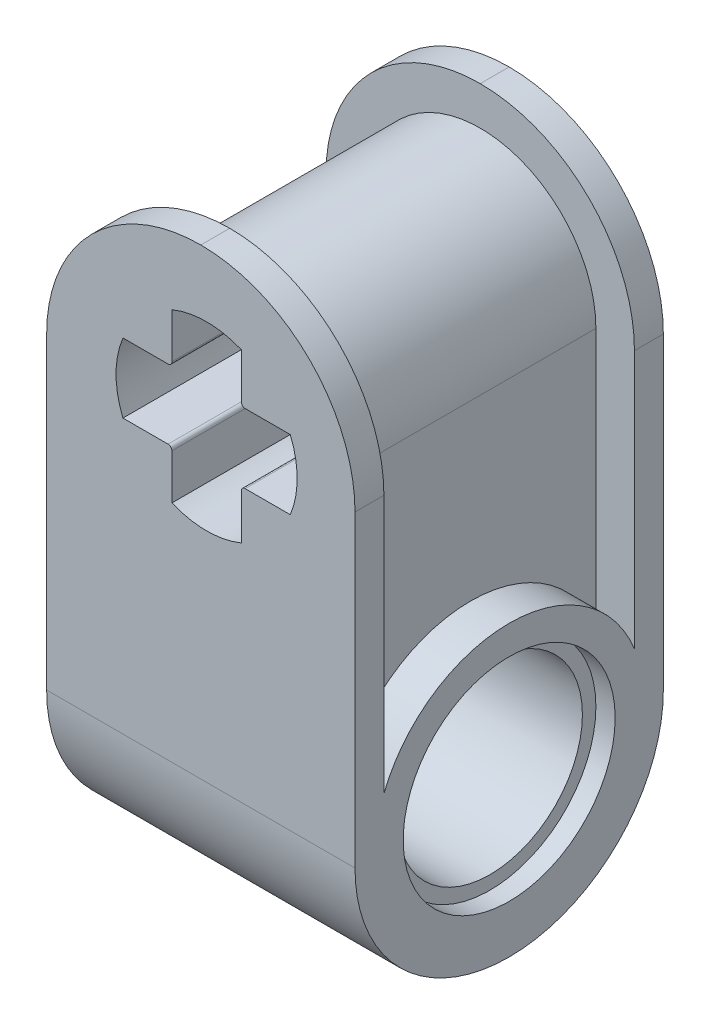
ISO-10303-21;
HEADER;
FILE_DESCRIPTION(('STEP AP214'),'2;1');
FILE_NAME('part.step','',(''),(''),'','','');
FILE_SCHEMA(('AUTOMOTIVE_DESIGN { 1 0 10303 214 1 1 1 1 }'));
ENDSEC;
DATA;
#1=APPLICATION_CONTEXT('core data for automotive mechanical design processes');
#2=APPLICATION_PROTOCOL_DEFINITION('international standard','automotive_design',2000,#1);
#3=PRODUCT_CONTEXT('',#1,'mechanical');
#4=PRODUCT('Part','Part','',(#3));
#5=PRODUCT_RELATED_PRODUCT_CATEGORY('part','',(#4));
#6=PRODUCT_DEFINITION_FORMATION('','',#4);
#7=PRODUCT_DEFINITION_CONTEXT('part definition',#1,'design');
#8=PRODUCT_DEFINITION('design','',#6,#7);
#9=PRODUCT_DEFINITION_SHAPE('','',#8);
#10=(LENGTH_UNIT() NAMED_UNIT(*) SI_UNIT(.MILLI.,.METRE.));
#11=(NAMED_UNIT(*) PLANE_ANGLE_UNIT() SI_UNIT($,.RADIAN.));
#12=(NAMED_UNIT(*) SI_UNIT($,.STERADIAN.) SOLID_ANGLE_UNIT());
#13=UNCERTAINTY_MEASURE_WITH_UNIT(LENGTH_MEASURE(1.E-05),#10,'distance_accuracy_value','');
#14=(GEOMETRIC_REPRESENTATION_CONTEXT(3) GLOBAL_UNCERTAINTY_ASSIGNED_CONTEXT((#13)) GLOBAL_UNIT_ASSIGNED_CONTEXT((#10,
#11,#12)) REPRESENTATION_CONTEXT('',''));
#15=CARTESIAN_POINT('',(0.,0.,0.));
#16=DIRECTION('',(0.,0.,1.));
#17=DIRECTION('',(1.,0.,0.));
#18=AXIS2_PLACEMENT_3D('',#15,#16,#17);
#19=CARTESIAN_POINT('',(-4.,0.,0.));
#20=DIRECTION('',(1.,0.,0.));
#21=DIRECTION('',(0.,0.,-1.));
#22=AXIS2_PLACEMENT_3D('',#19,#20,#21);
#23=PLANE('',#22);
#24=CARTESIAN_POINT('',(-4.,0.,0.));
#25=DIRECTION('',(1.,0.,0.));
#26=DIRECTION('',(0.,0.,-1.));
#27=AXIS2_PLACEMENT_3D('',#24,#25,#26);
#28=CIRCLE('',#27,2.75);
#29=CARTESIAN_POINT('',(-4.,0.,-2.75));
#30=VERTEX_POINT('',#29);
#31=EDGE_CURVE('E374',#30,#30,#28,.T.);
#32=ORIENTED_EDGE('',*,*,#31,.T.);
#33=EDGE_LOOP('',(#32));
#34=FACE_BOUND('',#33,.T.);
#35=DIRECTION('',(0.,-1.,0.));
#36=VECTOR('',#35,1.);
#37=CARTESIAN_POINT('',(-4.,0.,4.));
#38=LINE('',#37,#36);
#39=CARTESIAN_POINT('',(-4.,8.,4.));
#40=VERTEX_POINT('',#39);
#41=CARTESIAN_POINT('',(-4.,0.,4.));
#42=VERTEX_POINT('',#41);
#43=EDGE_CURVE('E422',#40,#42,#38,.T.);
#44=ORIENTED_EDGE('',*,*,#43,.F.);
#45=DIRECTION('',(0.,0.,1.));
#46=VECTOR('',#45,1.);
#47=CARTESIAN_POINT('',(-4.,8.,0.));
#48=LINE('',#47,#46);
#49=CARTESIAN_POINT('',(-4.,8.,3.25));
#50=VERTEX_POINT('',#49);
#51=EDGE_CURVE('E449',#40,#50,#48,.F.);
#52=ORIENTED_EDGE('',*,*,#51,.T.);
#53=DIRECTION('',(0.,-1.,0.));
#54=VECTOR('',#53,1.);
#55=CARTESIAN_POINT('',(-4.,8.,3.25));
#56=LINE('',#55,#54);
#57=CARTESIAN_POINT('',(-4.,1.29903810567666,3.25));
#58=VERTEX_POINT('',#57);
#59=EDGE_CURVE('E266',#50,#58,#56,.T.);
#60=ORIENTED_EDGE('',*,*,#59,.T.);
#61=CARTESIAN_POINT('',(-4.,0.,0.));
#62=DIRECTION('',(1.,0.,0.));
#63=DIRECTION('',(0.,0.,-1.));
#64=AXIS2_PLACEMENT_3D('',#61,#62,#63);
#65=CIRCLE('',#64,3.5);
#66=CARTESIAN_POINT('',(-4.,1.29903810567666,-3.25));
#67=VERTEX_POINT('',#66);
#68=EDGE_CURVE('E248',#67,#58,#65,.T.);
#69=ORIENTED_EDGE('',*,*,#68,.F.);
#70=DIRECTION('',(0.,-1.,0.));
#71=VECTOR('',#70,1.);
#72=CARTESIAN_POINT('',(-4.,8.,-3.25));
#73=LINE('',#72,#71);
#74=CARTESIAN_POINT('',(-4.,8.,-3.25));
#75=VERTEX_POINT('',#74);
#76=EDGE_CURVE('E269',#75,#67,#73,.T.);
#77=ORIENTED_EDGE('',*,*,#76,.F.);
#78=DIRECTION('',(0.,0.,1.));
#79=VECTOR('',#78,1.);
#80=CARTESIAN_POINT('',(-4.,8.,0.));
#81=LINE('',#80,#79);
#82=CARTESIAN_POINT('',(-4.,8.,-4.));
#83=VERTEX_POINT('',#82);
#84=EDGE_CURVE('E447',#75,#83,#81,.F.);
#85=ORIENTED_EDGE('',*,*,#84,.T.);
#86=DIRECTION('',(0.,1.,0.));
#87=VECTOR('',#86,1.);
#88=CARTESIAN_POINT('',(-4.,0.,-4.));
#89=LINE('',#88,#87);
#90=CARTESIAN_POINT('',(-4.,0.,-4.));
#91=VERTEX_POINT('',#90);
#92=EDGE_CURVE('E431',#91,#83,#89,.T.);
#93=ORIENTED_EDGE('',*,*,#92,.F.);
#94=CARTESIAN_POINT('',(-4.,0.,0.));
#95=DIRECTION('',(1.,0.,0.));
#96=DIRECTION('',(0.,0.,-1.));
#97=AXIS2_PLACEMENT_3D('',#94,#95,#96);
#98=CIRCLE('',#97,4.);
#99=EDGE_CURVE('E428',#42,#91,#98,.T.);
#100=ORIENTED_EDGE('',*,*,#99,.F.);
#101=EDGE_LOOP('',(#44,#52,#60,#69,#77,#85,#93,#100));
#102=FACE_BOUND('',#101,.T.);
#103=ADVANCED_FACE('F37',(#34,#102),#23,.F.);
#104=CARTESIAN_POINT('',(4.,0.,0.));
#105=DIRECTION('',(1.,0.,0.));
#106=DIRECTION('',(0.,0.,-1.));
#107=AXIS2_PLACEMENT_3D('',#104,#105,#106);
#108=PLANE('',#107);
#109=DIRECTION('',(0.,1.,0.));
#110=VECTOR('',#109,1.);
#111=CARTESIAN_POINT('',(4.,12.,3.25));
#112=LINE('',#111,#110);
#113=CARTESIAN_POINT('',(4.,1.29903810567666,3.25));
#114=VERTEX_POINT('',#113);
#115=CARTESIAN_POINT('',(4.,8.,3.25));
#116=VERTEX_POINT('',#115);
#117=EDGE_CURVE('E265',#114,#116,#112,.T.);
#118=ORIENTED_EDGE('',*,*,#117,.T.);
#119=DIRECTION('',(0.,0.,1.));
#120=VECTOR('',#119,1.);
#121=CARTESIAN_POINT('',(4.,8.,4.));
#122=LINE('',#121,#120);
#123=CARTESIAN_POINT('',(4.,8.,4.));
#124=VERTEX_POINT('',#123);
#125=EDGE_CURVE('E459',#116,#124,#122,.T.);
#126=ORIENTED_EDGE('',*,*,#125,.T.);
#127=DIRECTION('',(0.,-1.,0.));
#128=VECTOR('',#127,1.);
#129=CARTESIAN_POINT('',(4.,0.,4.));
#130=LINE('',#129,#128);
#131=CARTESIAN_POINT('',(4.,0.,4.));
#132=VERTEX_POINT('',#131);
#133=EDGE_CURVE('E425',#124,#132,#130,.T.);
#134=ORIENTED_EDGE('',*,*,#133,.T.);
#135=CARTESIAN_POINT('',(4.,0.,0.));
#136=DIRECTION('',(1.,0.,0.));
#137=DIRECTION('',(0.,0.,-1.));
#138=AXIS2_PLACEMENT_3D('',#135,#136,#137);
#139=CIRCLE('',#138,4.);
#140=CARTESIAN_POINT('',(4.,0.,-4.));
#141=VERTEX_POINT('',#140);
#142=EDGE_CURVE('E418',#132,#141,#139,.T.);
#143=ORIENTED_EDGE('',*,*,#142,.T.);
#144=DIRECTION('',(0.,1.,0.));
#145=VECTOR('',#144,1.);
#146=CARTESIAN_POINT('',(4.,0.,-4.));
#147=LINE('',#146,#145);
#148=CARTESIAN_POINT('',(4.,8.,-4.));
#149=VERTEX_POINT('',#148);
#150=EDGE_CURVE('E421',#141,#149,#147,.T.);
#151=ORIENTED_EDGE('',*,*,#150,.T.);
#152=DIRECTION('',(0.,0.,1.));
#153=VECTOR('',#152,1.);
#154=CARTESIAN_POINT('',(4.,8.,-3.25));
#155=LINE('',#154,#153);
#156=CARTESIAN_POINT('',(4.,8.,-3.25));
#157=VERTEX_POINT('',#156);
#158=EDGE_CURVE('E456',#149,#157,#155,.T.);
#159=ORIENTED_EDGE('',*,*,#158,.T.);
#160=DIRECTION('',(0.,1.,0.));
#161=VECTOR('',#160,1.);
#162=CARTESIAN_POINT('',(4.,12.,-3.25));
#163=LINE('',#162,#161);
#164=CARTESIAN_POINT('',(4.,1.29903810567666,-3.25));
#165=VERTEX_POINT('',#164);
#166=EDGE_CURVE('E258',#165,#157,#163,.T.);
#167=ORIENTED_EDGE('',*,*,#166,.F.);
#168=CARTESIAN_POINT('',(4.,0.,0.));
#169=DIRECTION('',(-1.,0.,0.));
#170=DIRECTION('',(0.,0.,-1.));
#171=AXIS2_PLACEMENT_3D('',#168,#169,#170);
#172=CIRCLE('',#171,3.5);
#173=EDGE_CURVE('E496',#114,#165,#172,.T.);
#174=ORIENTED_EDGE('',*,*,#173,.F.);
#175=EDGE_LOOP('',(#118,#126,#134,#143,#151,#159,#167,#174));
#176=FACE_BOUND('',#175,.T.);
#177=CARTESIAN_POINT('',(4.,0.,0.));
#178=DIRECTION('',(1.,0.,0.));
#179=DIRECTION('',(0.,0.,-1.));
#180=AXIS2_PLACEMENT_3D('',#177,#178,#179);
#181=CIRCLE('',#180,2.75);
#182=CARTESIAN_POINT('',(4.,0.,-2.75));
#183=VERTEX_POINT('',#182);
#184=EDGE_CURVE('E415',#183,#183,#181,.T.);
#185=ORIENTED_EDGE('',*,*,#184,.F.);
#186=EDGE_LOOP('',(#185));
#187=FACE_BOUND('',#186,.T.);
#188=ADVANCED_FACE('F494',(#176,#187),#108,.T.);
#189=CARTESIAN_POINT('',(4.,0.,0.));
#190=DIRECTION('',(-1.,0.,0.));
#191=DIRECTION('',(0.,0.,1.));
#192=AXIS2_PLACEMENT_3D('',#189,#190,#191);
#193=CYLINDRICAL_SURFACE('',#192,2.4);
#194=CARTESIAN_POINT('',(3.5,0.,0.));
#195=DIRECTION('',(1.,0.,0.));
#196=DIRECTION('',(0.,0.,-1.));
#197=AXIS2_PLACEMENT_3D('',#194,#195,#196);
#198=CIRCLE('',#197,2.4);
#199=CARTESIAN_POINT('',(3.5,0.,-2.4));
#200=VERTEX_POINT('',#199);
#201=EDGE_CURVE('E414',#200,#200,#198,.T.);
#202=ORIENTED_EDGE('',*,*,#201,.T.);
#203=EDGE_LOOP('',(#202));
#204=FACE_BOUND('',#203,.T.);
#205=CARTESIAN_POINT('',(-3.5,0.,0.));
#206=DIRECTION('',(-1.,0.,0.));
#207=DIRECTION('',(0.,0.,1.));
#208=AXIS2_PLACEMENT_3D('',#205,#206,#207);
#209=CIRCLE('',#208,2.4);
#210=CARTESIAN_POINT('',(-3.5,0.,2.4));
#211=VERTEX_POINT('',#210);
#212=EDGE_CURVE('E408',#211,#211,#209,.T.);
#213=ORIENTED_EDGE('',*,*,#212,.T.);
#214=EDGE_LOOP('',(#213));
#215=FACE_BOUND('',#214,.T.);
#216=ADVANCED_FACE('F534',(#204,#215),#193,.F.);
#217=CARTESIAN_POINT('',(4.,0.,0.));
#218=DIRECTION('',(-1.,0.,0.));
#219=DIRECTION('',(0.,0.,1.));
#220=AXIS2_PLACEMENT_3D('',#217,#218,#219);
#221=CYLINDRICAL_SURFACE('',#220,4.);
#222=ORIENTED_EDGE('',*,*,#99,.T.);
#223=DIRECTION('',(-1.,0.,0.));
#224=VECTOR('',#223,1.);
#225=CARTESIAN_POINT('',(4.,0.,-4.));
#226=LINE('',#225,#224);
#227=EDGE_CURVE('E436',#141,#91,#226,.T.);
#228=ORIENTED_EDGE('',*,*,#227,.F.);
#229=ORIENTED_EDGE('',*,*,#142,.F.);
#230=DIRECTION('',(-1.,0.,0.));
#231=VECTOR('',#230,1.);
#232=CARTESIAN_POINT('',(4.,0.,4.));
#233=LINE('',#232,#231);
#234=EDGE_CURVE('E427',#132,#42,#233,.T.);
#235=ORIENTED_EDGE('',*,*,#234,.T.);
#236=EDGE_LOOP('',(#222,#228,#229,#235));
#237=FACE_BOUND('',#236,.T.);
#238=ADVANCED_FACE('F502',(#237),#221,.T.);
#239=CARTESIAN_POINT('',(4.,0.,-4.));
#240=DIRECTION('',(0.,0.,1.));
#241=DIRECTION('',(1.,0.,0.));
#242=AXIS2_PLACEMENT_3D('',#239,#240,#241);
#243=PLANE('',#242);
#244=DIRECTION('',(-1.,0.,0.));
#245=VECTOR('',#244,1.);
#246=CARTESIAN_POINT('',(-2.02082933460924,8.9,-4.));
#247=LINE('',#246,#245);
#248=CARTESIAN_POINT('',(-0.85,8.9,-4.));
#249=VERTEX_POINT('',#248);
#250=CARTESIAN_POINT('',(-2.02082933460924,8.9,-4.));
#251=VERTEX_POINT('',#250);
#252=EDGE_CURVE('E323',#249,#251,#247,.T.);
#253=ORIENTED_EDGE('',*,*,#252,.T.);
#254=CARTESIAN_POINT('',(0.15,8.,-4.));
#255=DIRECTION('',(0.,0.,1.));
#256=DIRECTION('',(1.,0.,0.));
#257=AXIS2_PLACEMENT_3D('',#254,#255,#256);
#258=CIRCLE('',#257,2.35);
#259=CARTESIAN_POINT('',(-2.02082933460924,7.1,-4.));
#260=VERTEX_POINT('',#259);
#261=EDGE_CURVE('E277',#251,#260,#258,.T.);
#262=ORIENTED_EDGE('',*,*,#261,.T.);
#263=DIRECTION('',(1.,0.,0.));
#264=VECTOR('',#263,1.);
#265=CARTESIAN_POINT('',(-2.02082933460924,7.1,-4.));
#266=LINE('',#265,#264);
#267=CARTESIAN_POINT('',(-0.85,7.1,-4.));
#268=VERTEX_POINT('',#267);
#269=EDGE_CURVE('E280',#260,#268,#266,.T.);
#270=ORIENTED_EDGE('',*,*,#269,.T.);
#271=CARTESIAN_POINT('',(-0.85,7.,-4.));
#272=DIRECTION('',(0.,0.,-1.));
#273=DIRECTION('',(-1.,0.,0.));
#274=AXIS2_PLACEMENT_3D('',#271,#272,#273);
#275=CIRCLE('',#274,0.0999999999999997);
#276=CARTESIAN_POINT('',(-0.75,7.,-4.));
#277=VERTEX_POINT('',#276);
#278=EDGE_CURVE('E284',#268,#277,#275,.T.);
#279=ORIENTED_EDGE('',*,*,#278,.T.);
#280=DIRECTION('',(0.,-1.,0.));
#281=VECTOR('',#280,1.);
#282=CARTESIAN_POINT('',(-0.75,7.,-4.));
#283=LINE('',#282,#281);
#284=CARTESIAN_POINT('',(-0.75,5.82917066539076,-4.));
#285=VERTEX_POINT('',#284);
#286=EDGE_CURVE('E287',#277,#285,#283,.T.);
#287=ORIENTED_EDGE('',*,*,#286,.T.);
#288=CARTESIAN_POINT('',(0.15,8.,-4.));
#289=DIRECTION('',(0.,0.,1.));
#290=DIRECTION('',(-1.,0.,0.));
#291=AXIS2_PLACEMENT_3D('',#288,#289,#290);
#292=CIRCLE('',#291,2.35);
#293=CARTESIAN_POINT('',(1.05,5.82917066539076,-4.));
#294=VERTEX_POINT('',#293);
#295=EDGE_CURVE('E290',#285,#294,#292,.T.);
#296=ORIENTED_EDGE('',*,*,#295,.T.);
#297=DIRECTION('',(0.,1.,0.));
#298=VECTOR('',#297,1.);
#299=CARTESIAN_POINT('',(1.05,7.,-4.));
#300=LINE('',#299,#298);
#301=CARTESIAN_POINT('',(1.05,7.,-4.));
#302=VERTEX_POINT('',#301);
#303=EDGE_CURVE('E293',#294,#302,#300,.T.);
#304=ORIENTED_EDGE('',*,*,#303,.T.);
#305=CARTESIAN_POINT('',(1.15,7.,-4.));
#306=DIRECTION('',(0.,0.,-1.));
#307=DIRECTION('',(1.,0.,0.));
#308=AXIS2_PLACEMENT_3D('',#305,#306,#307);
#309=CIRCLE('',#308,0.0999999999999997);
#310=CARTESIAN_POINT('',(1.15,7.1,-4.));
#311=VERTEX_POINT('',#310);
#312=EDGE_CURVE('E296',#302,#311,#309,.T.);
#313=ORIENTED_EDGE('',*,*,#312,.T.);
#314=DIRECTION('',(1.,0.,0.));
#315=VECTOR('',#314,1.);
#316=CARTESIAN_POINT('',(2.32082933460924,7.1,-4.));
#317=LINE('',#316,#315);
#318=CARTESIAN_POINT('',(2.32082933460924,7.1,-4.));
#319=VERTEX_POINT('',#318);
#320=EDGE_CURVE('E299',#311,#319,#317,.T.);
#321=ORIENTED_EDGE('',*,*,#320,.T.);
#322=CARTESIAN_POINT('',(0.15,8.,-4.));
#323=DIRECTION('',(0.,0.,1.));
#324=DIRECTION('',(-1.,0.,0.));
#325=AXIS2_PLACEMENT_3D('',#322,#323,#324);
#326=CIRCLE('',#325,2.35);
#327=CARTESIAN_POINT('',(2.32082933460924,8.9,-4.));
#328=VERTEX_POINT('',#327);
#329=EDGE_CURVE('E302',#319,#328,#326,.T.);
#330=ORIENTED_EDGE('',*,*,#329,.T.);
#331=DIRECTION('',(-1.,0.,0.));
#332=VECTOR('',#331,1.);
#333=CARTESIAN_POINT('',(2.32082933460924,8.9,-4.));
#334=LINE('',#333,#332);
#335=CARTESIAN_POINT('',(1.15,8.9,-4.));
#336=VERTEX_POINT('',#335);
#337=EDGE_CURVE('E305',#328,#336,#334,.T.);
#338=ORIENTED_EDGE('',*,*,#337,.T.);
#339=CARTESIAN_POINT('',(1.15,9.,-4.));
#340=DIRECTION('',(0.,0.,-1.));
#341=DIRECTION('',(-1.,0.,0.));
#342=AXIS2_PLACEMENT_3D('',#339,#340,#341);
#343=CIRCLE('',#342,0.0999999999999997);
#344=CARTESIAN_POINT('',(1.05,9.,-4.));
#345=VERTEX_POINT('',#344);
#346=EDGE_CURVE('E308',#336,#345,#343,.T.);
#347=ORIENTED_EDGE('',*,*,#346,.T.);
#348=DIRECTION('',(0.,1.,0.));
#349=VECTOR('',#348,1.);
#350=CARTESIAN_POINT('',(1.05,9.,-4.));
#351=LINE('',#350,#349);
#352=CARTESIAN_POINT('',(1.05,10.1708293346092,-4.));
#353=VERTEX_POINT('',#352);
#354=EDGE_CURVE('E311',#345,#353,#351,.T.);
#355=ORIENTED_EDGE('',*,*,#354,.T.);
#356=CARTESIAN_POINT('',(0.15,8.,-4.));
#357=DIRECTION('',(0.,0.,1.));
#358=DIRECTION('',(1.,0.,0.));
#359=AXIS2_PLACEMENT_3D('',#356,#357,#358);
#360=CIRCLE('',#359,2.35);
#361=CARTESIAN_POINT('',(-0.75,10.1708293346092,-4.));
#362=VERTEX_POINT('',#361);
#363=EDGE_CURVE('E314',#353,#362,#360,.T.);
#364=ORIENTED_EDGE('',*,*,#363,.T.);
#365=DIRECTION('',(0.,-1.,0.));
#366=VECTOR('',#365,1.);
#367=CARTESIAN_POINT('',(-0.75,9.,-4.));
#368=LINE('',#367,#366);
#369=CARTESIAN_POINT('',(-0.750000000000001,9.,-4.));
#370=VERTEX_POINT('',#369);
#371=EDGE_CURVE('E317',#362,#370,#368,.T.);
#372=ORIENTED_EDGE('',*,*,#371,.T.);
#373=CARTESIAN_POINT('',(-0.85,9.,-4.));
#374=DIRECTION('',(0.,0.,-1.));
#375=DIRECTION('',(1.,0.,0.));
#376=AXIS2_PLACEMENT_3D('',#373,#374,#375);
#377=CIRCLE('',#376,0.0999999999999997);
#378=EDGE_CURVE('E320',#370,#249,#377,.T.);
#379=ORIENTED_EDGE('',*,*,#378,.T.);
#380=EDGE_LOOP('',(#253,#262,#270,#279,#287,#296,#304,#313,#321,#330,#338,#347,#355,#364,#372,#379));
#381=FACE_BOUND('',#380,.T.);
#382=CARTESIAN_POINT('',(0.,8.,-4.));
#383=DIRECTION('',(0.,0.,1.));
#384=DIRECTION('',(1.,0.,0.));
#385=AXIS2_PLACEMENT_3D('',#382,#383,#384);
#386=CIRCLE('',#385,4.);
#387=CARTESIAN_POINT('',(0.,12.,-4.));
#388=VERTEX_POINT('',#387);
#389=EDGE_CURVE('E46',#83,#388,#386,.F.);
#390=ORIENTED_EDGE('',*,*,#389,.T.);
#391=CARTESIAN_POINT('',(0.,8.,-4.));
#392=DIRECTION('',(0.,0.,1.));
#393=DIRECTION('',(1.,0.,0.));
#394=AXIS2_PLACEMENT_3D('',#391,#392,#393);
#395=CIRCLE('',#394,4.);
#396=EDGE_CURVE('E11',#388,#149,#395,.F.);
#397=ORIENTED_EDGE('',*,*,#396,.T.);
#398=ORIENTED_EDGE('',*,*,#150,.F.);
#399=ORIENTED_EDGE('',*,*,#227,.T.);
#400=ORIENTED_EDGE('',*,*,#92,.T.);
#401=EDGE_LOOP('',(#390,#397,#398,#399,#400));
#402=FACE_BOUND('',#401,.T.);
#403=ADVANCED_FACE('F499',(#381,#402),#243,.F.);
#404=CARTESIAN_POINT('',(4.,0.,4.));
#405=DIRECTION('',(0.,0.,-1.));
#406=DIRECTION('',(-1.,0.,0.));
#407=AXIS2_PLACEMENT_3D('',#404,#405,#406);
#408=PLANE('',#407);
#409=DIRECTION('',(1.,0.,0.));
#410=VECTOR('',#409,1.);
#411=CARTESIAN_POINT('',(-2.02082933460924,7.1,4.));
#412=LINE('',#411,#410);
#413=CARTESIAN_POINT('',(-2.02082933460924,7.1,4.));
#414=VERTEX_POINT('',#413);
#415=CARTESIAN_POINT('',(-0.85,7.1,4.));
#416=VERTEX_POINT('',#415);
#417=EDGE_CURVE('E328',#414,#416,#412,.T.);
#418=ORIENTED_EDGE('',*,*,#417,.F.);
#419=CARTESIAN_POINT('',(0.15,8.,4.));
#420=DIRECTION('',(0.,0.,1.));
#421=DIRECTION('',(1.,0.,0.));
#422=AXIS2_PLACEMENT_3D('',#419,#420,#421);
#423=CIRCLE('',#422,2.35);
#424=CARTESIAN_POINT('',(-2.02082933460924,8.9,4.));
#425=VERTEX_POINT('',#424);
#426=EDGE_CURVE('E275',#425,#414,#423,.T.);
#427=ORIENTED_EDGE('',*,*,#426,.F.);
#428=DIRECTION('',(-1.,0.,0.));
#429=VECTOR('',#428,1.);
#430=CARTESIAN_POINT('',(-2.02082933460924,8.9,4.));
#431=LINE('',#430,#429);
#432=CARTESIAN_POINT('',(-0.85,8.9,4.));
#433=VERTEX_POINT('',#432);
#434=EDGE_CURVE('E281',#433,#425,#431,.T.);
#435=ORIENTED_EDGE('',*,*,#434,.F.);
#436=CARTESIAN_POINT('',(-0.85,9.,4.));
#437=DIRECTION('',(0.,0.,-1.));
#438=DIRECTION('',(1.,0.,0.));
#439=AXIS2_PLACEMENT_3D('',#436,#437,#438);
#440=CIRCLE('',#439,0.0999999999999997);
#441=CARTESIAN_POINT('',(-0.750000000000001,9.,4.));
#442=VERTEX_POINT('',#441);
#443=EDGE_CURVE('E367',#442,#433,#440,.T.);
#444=ORIENTED_EDGE('',*,*,#443,.F.);
#445=DIRECTION('',(0.,-1.,0.));
#446=VECTOR('',#445,1.);
#447=CARTESIAN_POINT('',(-0.75,9.,4.));
#448=LINE('',#447,#446);
#449=CARTESIAN_POINT('',(-0.75,10.1708293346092,4.));
#450=VERTEX_POINT('',#449);
#451=EDGE_CURVE('E364',#450,#442,#448,.T.);
#452=ORIENTED_EDGE('',*,*,#451,.F.);
#453=CARTESIAN_POINT('',(0.15,8.,4.));
#454=DIRECTION('',(0.,0.,1.));
#455=DIRECTION('',(1.,0.,0.));
#456=AXIS2_PLACEMENT_3D('',#453,#454,#455);
#457=CIRCLE('',#456,2.35);
#458=CARTESIAN_POINT('',(1.05,10.1708293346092,4.));
#459=VERTEX_POINT('',#458);
#460=EDGE_CURVE('E361',#459,#450,#457,.T.);
#461=ORIENTED_EDGE('',*,*,#460,.F.);
#462=DIRECTION('',(0.,1.,0.));
#463=VECTOR('',#462,1.);
#464=CARTESIAN_POINT('',(1.05,9.,4.));
#465=LINE('',#464,#463);
#466=CARTESIAN_POINT('',(1.05,9.,4.));
#467=VERTEX_POINT('',#466);
#468=EDGE_CURVE('E358',#467,#459,#465,.T.);
#469=ORIENTED_EDGE('',*,*,#468,.F.);
#470=CARTESIAN_POINT('',(1.15,9.,4.));
#471=DIRECTION('',(0.,0.,-1.));
#472=DIRECTION('',(-1.,0.,0.));
#473=AXIS2_PLACEMENT_3D('',#470,#471,#472);
#474=CIRCLE('',#473,0.0999999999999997);
#475=CARTESIAN_POINT('',(1.15,8.9,4.));
#476=VERTEX_POINT('',#475);
#477=EDGE_CURVE('E355',#476,#467,#474,.T.);
#478=ORIENTED_EDGE('',*,*,#477,.F.);
#479=DIRECTION('',(-1.,0.,0.));
#480=VECTOR('',#479,1.);
#481=CARTESIAN_POINT('',(2.32082933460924,8.9,4.));
#482=LINE('',#481,#480);
#483=CARTESIAN_POINT('',(2.32082933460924,8.9,4.));
#484=VERTEX_POINT('',#483);
#485=EDGE_CURVE('E352',#484,#476,#482,.T.);
#486=ORIENTED_EDGE('',*,*,#485,.F.);
#487=CARTESIAN_POINT('',(0.15,8.,4.));
#488=DIRECTION('',(0.,0.,1.));
#489=DIRECTION('',(-1.,0.,0.));
#490=AXIS2_PLACEMENT_3D('',#487,#488,#489);
#491=CIRCLE('',#490,2.35);
#492=CARTESIAN_POINT('',(2.32082933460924,7.1,4.));
#493=VERTEX_POINT('',#492);
#494=EDGE_CURVE('E349',#493,#484,#491,.T.);
#495=ORIENTED_EDGE('',*,*,#494,.F.);
#496=DIRECTION('',(1.,0.,0.));
#497=VECTOR('',#496,1.);
#498=CARTESIAN_POINT('',(2.32082933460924,7.1,4.));
#499=LINE('',#498,#497);
#500=CARTESIAN_POINT('',(1.15,7.1,4.));
#501=VERTEX_POINT('',#500);
#502=EDGE_CURVE('E346',#501,#493,#499,.T.);
#503=ORIENTED_EDGE('',*,*,#502,.F.);
#504=CARTESIAN_POINT('',(1.15,7.,4.));
#505=DIRECTION('',(0.,0.,-1.));
#506=DIRECTION('',(1.,0.,0.));
#507=AXIS2_PLACEMENT_3D('',#504,#505,#506);
#508=CIRCLE('',#507,0.0999999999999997);
#509=CARTESIAN_POINT('',(1.05,7.,4.));
#510=VERTEX_POINT('',#509);
#511=EDGE_CURVE('E343',#510,#501,#508,.T.);
#512=ORIENTED_EDGE('',*,*,#511,.F.);
#513=DIRECTION('',(0.,1.,0.));
#514=VECTOR('',#513,1.);
#515=CARTESIAN_POINT('',(1.05,7.,4.));
#516=LINE('',#515,#514);
#517=CARTESIAN_POINT('',(1.05,5.82917066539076,4.));
#518=VERTEX_POINT('',#517);
#519=EDGE_CURVE('E340',#518,#510,#516,.T.);
#520=ORIENTED_EDGE('',*,*,#519,.F.);
#521=CARTESIAN_POINT('',(0.15,8.,4.));
#522=DIRECTION('',(0.,0.,1.));
#523=DIRECTION('',(-1.,0.,0.));
#524=AXIS2_PLACEMENT_3D('',#521,#522,#523);
#525=CIRCLE('',#524,2.35);
#526=CARTESIAN_POINT('',(-0.75,5.82917066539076,4.));
#527=VERTEX_POINT('',#526);
#528=EDGE_CURVE('E337',#527,#518,#525,.T.);
#529=ORIENTED_EDGE('',*,*,#528,.F.);
#530=DIRECTION('',(0.,-1.,0.));
#531=VECTOR('',#530,1.);
#532=CARTESIAN_POINT('',(-0.75,7.,4.));
#533=LINE('',#532,#531);
#534=CARTESIAN_POINT('',(-0.75,7.,4.));
#535=VERTEX_POINT('',#534);
#536=EDGE_CURVE('E334',#535,#527,#533,.T.);
#537=ORIENTED_EDGE('',*,*,#536,.F.);
#538=CARTESIAN_POINT('',(-0.85,7.,4.));
#539=DIRECTION('',(0.,0.,-1.));
#540=DIRECTION('',(-1.,0.,0.));
#541=AXIS2_PLACEMENT_3D('',#538,#539,#540);
#542=CIRCLE('',#541,0.0999999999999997);
#543=EDGE_CURVE('E331',#416,#535,#542,.T.);
#544=ORIENTED_EDGE('',*,*,#543,.F.);
#545=EDGE_LOOP('',(#418,#427,#435,#444,#452,#461,#469,#478,#486,#495,#503,#512,#520,#529,#537,#544));
#546=FACE_BOUND('',#545,.T.);
#547=CARTESIAN_POINT('',(0.,8.,4.));
#548=DIRECTION('',(0.,0.,-1.));
#549=DIRECTION('',(-1.,0.,0.));
#550=AXIS2_PLACEMENT_3D('',#547,#548,#549);
#551=CIRCLE('',#550,4.);
#552=CARTESIAN_POINT('',(0.,12.,4.));
#553=VERTEX_POINT('',#552);
#554=EDGE_CURVE('E439',#124,#553,#551,.F.);
#555=ORIENTED_EDGE('',*,*,#554,.T.);
#556=CARTESIAN_POINT('',(0.,8.,4.));
#557=DIRECTION('',(0.,0.,-1.));
#558=DIRECTION('',(-1.,0.,0.));
#559=AXIS2_PLACEMENT_3D('',#556,#557,#558);
#560=CIRCLE('',#559,4.);
#561=EDGE_CURVE('E445',#553,#40,#560,.F.);
#562=ORIENTED_EDGE('',*,*,#561,.T.);
#563=ORIENTED_EDGE('',*,*,#43,.T.);
#564=ORIENTED_EDGE('',*,*,#234,.F.);
#565=ORIENTED_EDGE('',*,*,#133,.F.);
#566=EDGE_LOOP('',(#555,#562,#563,#564,#565));
#567=FACE_BOUND('',#566,.T.);
#568=ADVANCED_FACE('F513',(#546,#567),#408,.F.);
#569=CARTESIAN_POINT('',(3.5,0.,0.));
#570=DIRECTION('',(1.,0.,0.));
#571=DIRECTION('',(0.,0.,-1.));
#572=AXIS2_PLACEMENT_3D('',#569,#570,#571);
#573=CYLINDRICAL_SURFACE('',#572,2.75);
#574=CARTESIAN_POINT('',(3.5,0.,0.));
#575=DIRECTION('',(1.,0.,0.));
#576=DIRECTION('',(0.,0.,-1.));
#577=AXIS2_PLACEMENT_3D('',#574,#575,#576);
#578=CIRCLE('',#577,2.75);
#579=CARTESIAN_POINT('',(3.5,0.,-2.75));
#580=VERTEX_POINT('',#579);
#581=EDGE_CURVE('E411',#580,#580,#578,.T.);
#582=ORIENTED_EDGE('',*,*,#581,.F.);
#583=EDGE_LOOP('',(#582));
#584=FACE_BOUND('',#583,.T.);
#585=ORIENTED_EDGE('',*,*,#184,.T.);
#586=EDGE_LOOP('',(#585));
#587=FACE_BOUND('',#586,.T.);
#588=ADVANCED_FACE('F515',(#584,#587),#573,.F.);
#589=CARTESIAN_POINT('',(3.5,0.,0.));
#590=DIRECTION('',(1.,0.,0.));
#591=DIRECTION('',(0.,0.,-1.));
#592=AXIS2_PLACEMENT_3D('',#589,#590,#591);
#593=PLANE('',#592);
#594=ORIENTED_EDGE('',*,*,#201,.F.);
#595=EDGE_LOOP('',(#594));
#596=FACE_BOUND('',#595,.T.);
#597=ORIENTED_EDGE('',*,*,#581,.T.);
#598=EDGE_LOOP('',(#597));
#599=FACE_BOUND('',#598,.T.);
#600=ADVANCED_FACE('F522',(#596,#599),#593,.T.);
#601=CARTESIAN_POINT('',(-3.5,0.,0.));
#602=DIRECTION('',(-1.,0.,0.));
#603=DIRECTION('',(0.,0.,1.));
#604=AXIS2_PLACEMENT_3D('',#601,#602,#603);
#605=CYLINDRICAL_SURFACE('',#604,2.75);
#606=CARTESIAN_POINT('',(-3.5,0.,0.));
#607=DIRECTION('',(1.,0.,0.));
#608=DIRECTION('',(0.,0.,-1.));
#609=AXIS2_PLACEMENT_3D('',#606,#607,#608);
#610=CIRCLE('',#609,2.75);
#611=CARTESIAN_POINT('',(-3.5,0.,-2.75));
#612=VERTEX_POINT('',#611);
#613=EDGE_CURVE('E405',#612,#612,#610,.T.);
#614=ORIENTED_EDGE('',*,*,#613,.T.);
#615=EDGE_LOOP('',(#614));
#616=FACE_BOUND('',#615,.T.);
#617=ORIENTED_EDGE('',*,*,#31,.F.);
#618=EDGE_LOOP('',(#617));
#619=FACE_BOUND('',#618,.T.);
#620=ADVANCED_FACE('F542',(#616,#619),#605,.F.);
#621=CARTESIAN_POINT('',(-3.5,0.,0.));
#622=DIRECTION('',(-1.,0.,0.));
#623=DIRECTION('',(0.,0.,-1.));
#624=AXIS2_PLACEMENT_3D('',#621,#622,#623);
#625=PLANE('',#624);
#626=ORIENTED_EDGE('',*,*,#212,.F.);
#627=EDGE_LOOP('',(#626));
#628=FACE_BOUND('',#627,.T.);
#629=ORIENTED_EDGE('',*,*,#613,.F.);
#630=EDGE_LOOP('',(#629));
#631=FACE_BOUND('',#630,.T.);
#632=ADVANCED_FACE('F546',(#628,#631),#625,.T.);
#633=CARTESIAN_POINT('',(0.15,8.,-4.));
#634=DIRECTION('',(0.,0.,1.));
#635=DIRECTION('',(1.,0.,0.));
#636=AXIS2_PLACEMENT_3D('',#633,#634,#635);
#637=CYLINDRICAL_SURFACE('',#636,2.35);
#638=ORIENTED_EDGE('',*,*,#426,.T.);
#639=DIRECTION('',(0.,0.,1.));
#640=VECTOR('',#639,1.);
#641=CARTESIAN_POINT('',(-2.02082933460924,7.1,-4.));
#642=LINE('',#641,#640);
#643=EDGE_CURVE('E326',#260,#414,#642,.T.);
#644=ORIENTED_EDGE('',*,*,#643,.F.);
#645=ORIENTED_EDGE('',*,*,#261,.F.);
#646=DIRECTION('',(0.,0.,1.));
#647=VECTOR('',#646,1.);
#648=CARTESIAN_POINT('',(-2.02082933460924,8.9,-4.));
#649=LINE('',#648,#647);
#650=EDGE_CURVE('E372',#251,#425,#649,.T.);
#651=ORIENTED_EDGE('',*,*,#650,.T.);
#652=EDGE_LOOP('',(#638,#644,#645,#651));
#653=FACE_BOUND('',#652,.T.);
#654=ADVANCED_FACE('F550',(#653),#637,.F.);
#655=CARTESIAN_POINT('',(-2.02082933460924,8.9,-4.));
#656=DIRECTION('',(0.,1.,0.));
#657=DIRECTION('',(-1.,0.,0.));
#658=AXIS2_PLACEMENT_3D('',#655,#656,#657);
#659=PLANE('',#658);
#660=ORIENTED_EDGE('',*,*,#434,.T.);
#661=ORIENTED_EDGE('',*,*,#650,.F.);
#662=ORIENTED_EDGE('',*,*,#252,.F.);
#663=DIRECTION('',(0.,0.,1.));
#664=VECTOR('',#663,1.);
#665=CARTESIAN_POINT('',(-0.85,8.9,-4.));
#666=LINE('',#665,#664);
#667=EDGE_CURVE('E375',#249,#433,#666,.T.);
#668=ORIENTED_EDGE('',*,*,#667,.T.);
#669=EDGE_LOOP('',(#660,#661,#662,#668));
#670=FACE_BOUND('',#669,.T.);
#671=ADVANCED_FACE('F554',(#670),#659,.F.);
#672=CARTESIAN_POINT('',(-0.85,9.,-4.));
#673=DIRECTION('',(0.,0.,1.));
#674=DIRECTION('',(1.,0.,0.));
#675=AXIS2_PLACEMENT_3D('',#672,#673,#674);
#676=CYLINDRICAL_SURFACE('',#675,0.0999999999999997);
#677=ORIENTED_EDGE('',*,*,#443,.T.);
#678=ORIENTED_EDGE('',*,*,#667,.F.);
#679=ORIENTED_EDGE('',*,*,#378,.F.);
#680=DIRECTION('',(0.,0.,1.));
#681=VECTOR('',#680,1.);
#682=CARTESIAN_POINT('',(-0.750000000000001,9.,-4.));
#683=LINE('',#682,#681);
#684=EDGE_CURVE('E377',#370,#442,#683,.T.);
#685=ORIENTED_EDGE('',*,*,#684,.T.);
#686=EDGE_LOOP('',(#677,#678,#679,#685));
#687=FACE_BOUND('',#686,.T.);
#688=ADVANCED_FACE('F607',(#687),#676,.T.);
#689=CARTESIAN_POINT('',(-0.75,9.,-4.));
#690=DIRECTION('',(-1.,0.,0.));
#691=DIRECTION('',(0.,-1.,0.));
#692=AXIS2_PLACEMENT_3D('',#689,#690,#691);
#693=PLANE('',#692);
#694=ORIENTED_EDGE('',*,*,#451,.T.);
#695=ORIENTED_EDGE('',*,*,#684,.F.);
#696=ORIENTED_EDGE('',*,*,#371,.F.);
#697=DIRECTION('',(0.,0.,1.));
#698=VECTOR('',#697,1.);
#699=CARTESIAN_POINT('',(-0.75,10.1708293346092,-4.));
#700=LINE('',#699,#698);
#701=EDGE_CURVE('E379',#362,#450,#700,.T.);
#702=ORIENTED_EDGE('',*,*,#701,.T.);
#703=EDGE_LOOP('',(#694,#695,#696,#702));
#704=FACE_BOUND('',#703,.T.);
#705=ADVANCED_FACE('F603',(#704),#693,.F.);
#706=CARTESIAN_POINT('',(0.15,8.,-4.));
#707=DIRECTION('',(0.,0.,1.));
#708=DIRECTION('',(1.,0.,0.));
#709=AXIS2_PLACEMENT_3D('',#706,#707,#708);
#710=CYLINDRICAL_SURFACE('',#709,2.35);
#711=ORIENTED_EDGE('',*,*,#460,.T.);
#712=ORIENTED_EDGE('',*,*,#701,.F.);
#713=ORIENTED_EDGE('',*,*,#363,.F.);
#714=DIRECTION('',(0.,0.,1.));
#715=VECTOR('',#714,1.);
#716=CARTESIAN_POINT('',(1.05,10.1708293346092,-4.));
#717=LINE('',#716,#715);
#718=EDGE_CURVE('E381',#353,#459,#717,.T.);
#719=ORIENTED_EDGE('',*,*,#718,.T.);
#720=EDGE_LOOP('',(#711,#712,#713,#719));
#721=FACE_BOUND('',#720,.T.);
#722=ADVANCED_FACE('F599',(#721),#710,.F.);
#723=CARTESIAN_POINT('',(1.05,9.,-4.));
#724=DIRECTION('',(1.,0.,0.));
#725=DIRECTION('',(0.,0.,-1.));
#726=AXIS2_PLACEMENT_3D('',#723,#724,#725);
#727=PLANE('',#726);
#728=ORIENTED_EDGE('',*,*,#468,.T.);
#729=ORIENTED_EDGE('',*,*,#718,.F.);
#730=ORIENTED_EDGE('',*,*,#354,.F.);
#731=DIRECTION('',(0.,0.,1.));
#732=VECTOR('',#731,1.);
#733=CARTESIAN_POINT('',(1.05,9.,-4.));
#734=LINE('',#733,#732);
#735=EDGE_CURVE('E383',#345,#467,#734,.T.);
#736=ORIENTED_EDGE('',*,*,#735,.T.);
#737=EDGE_LOOP('',(#728,#729,#730,#736));
#738=FACE_BOUND('',#737,.T.);
#739=ADVANCED_FACE('F595',(#738),#727,.F.);
#740=CARTESIAN_POINT('',(1.15,9.,-4.));
#741=DIRECTION('',(0.,0.,1.));
#742=DIRECTION('',(1.,0.,0.));
#743=AXIS2_PLACEMENT_3D('',#740,#741,#742);
#744=CYLINDRICAL_SURFACE('',#743,0.0999999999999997);
#745=ORIENTED_EDGE('',*,*,#477,.T.);
#746=ORIENTED_EDGE('',*,*,#735,.F.);
#747=ORIENTED_EDGE('',*,*,#346,.F.);
#748=DIRECTION('',(0.,0.,1.));
#749=VECTOR('',#748,1.);
#750=CARTESIAN_POINT('',(1.15,8.9,-4.));
#751=LINE('',#750,#749);
#752=EDGE_CURVE('E385',#336,#476,#751,.T.);
#753=ORIENTED_EDGE('',*,*,#752,.T.);
#754=EDGE_LOOP('',(#745,#746,#747,#753));
#755=FACE_BOUND('',#754,.T.);
#756=ADVANCED_FACE('F591',(#755),#744,.T.);
#757=CARTESIAN_POINT('',(2.32082933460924,8.9,-4.));
#758=DIRECTION('',(0.,1.,0.));
#759=DIRECTION('',(-1.,0.,0.));
#760=AXIS2_PLACEMENT_3D('',#757,#758,#759);
#761=PLANE('',#760);
#762=ORIENTED_EDGE('',*,*,#485,.T.);
#763=ORIENTED_EDGE('',*,*,#752,.F.);
#764=ORIENTED_EDGE('',*,*,#337,.F.);
#765=DIRECTION('',(0.,0.,1.));
#766=VECTOR('',#765,1.);
#767=CARTESIAN_POINT('',(2.32082933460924,8.9,-4.));
#768=LINE('',#767,#766);
#769=EDGE_CURVE('E387',#328,#484,#768,.T.);
#770=ORIENTED_EDGE('',*,*,#769,.T.);
#771=EDGE_LOOP('',(#762,#763,#764,#770));
#772=FACE_BOUND('',#771,.T.);
#773=ADVANCED_FACE('F587',(#772),#761,.F.);
#774=CARTESIAN_POINT('',(0.15,8.,-4.));
#775=DIRECTION('',(0.,0.,1.));
#776=DIRECTION('',(1.,0.,0.));
#777=AXIS2_PLACEMENT_3D('',#774,#775,#776);
#778=CYLINDRICAL_SURFACE('',#777,2.35);
#779=ORIENTED_EDGE('',*,*,#494,.T.);
#780=ORIENTED_EDGE('',*,*,#769,.F.);
#781=ORIENTED_EDGE('',*,*,#329,.F.);
#782=DIRECTION('',(0.,0.,1.));
#783=VECTOR('',#782,1.);
#784=CARTESIAN_POINT('',(2.32082933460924,7.1,-4.));
#785=LINE('',#784,#783);
#786=EDGE_CURVE('E389',#319,#493,#785,.T.);
#787=ORIENTED_EDGE('',*,*,#786,.T.);
#788=EDGE_LOOP('',(#779,#780,#781,#787));
#789=FACE_BOUND('',#788,.T.);
#790=ADVANCED_FACE('F583',(#789),#778,.F.);
#791=CARTESIAN_POINT('',(2.32082933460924,7.1,-4.));
#792=DIRECTION('',(0.,-1.,0.));
#793=DIRECTION('',(1.,0.,0.));
#794=AXIS2_PLACEMENT_3D('',#791,#792,#793);
#795=PLANE('',#794);
#796=ORIENTED_EDGE('',*,*,#502,.T.);
#797=ORIENTED_EDGE('',*,*,#786,.F.);
#798=ORIENTED_EDGE('',*,*,#320,.F.);
#799=DIRECTION('',(0.,0.,1.));
#800=VECTOR('',#799,1.);
#801=CARTESIAN_POINT('',(1.15,7.1,-4.));
#802=LINE('',#801,#800);
#803=EDGE_CURVE('E391',#311,#501,#802,.T.);
#804=ORIENTED_EDGE('',*,*,#803,.T.);
#805=EDGE_LOOP('',(#796,#797,#798,#804));
#806=FACE_BOUND('',#805,.T.);
#807=ADVANCED_FACE('F579',(#806),#795,.F.);
#808=CARTESIAN_POINT('',(1.15,7.,-4.));
#809=DIRECTION('',(0.,0.,1.));
#810=DIRECTION('',(1.,0.,0.));
#811=AXIS2_PLACEMENT_3D('',#808,#809,#810);
#812=CYLINDRICAL_SURFACE('',#811,0.0999999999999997);
#813=ORIENTED_EDGE('',*,*,#511,.T.);
#814=ORIENTED_EDGE('',*,*,#803,.F.);
#815=ORIENTED_EDGE('',*,*,#312,.F.);
#816=DIRECTION('',(0.,0.,1.));
#817=VECTOR('',#816,1.);
#818=CARTESIAN_POINT('',(1.05,7.,-4.));
#819=LINE('',#818,#817);
#820=EDGE_CURVE('E393',#302,#510,#819,.T.);
#821=ORIENTED_EDGE('',*,*,#820,.T.);
#822=EDGE_LOOP('',(#813,#814,#815,#821));
#823=FACE_BOUND('',#822,.T.);
#824=ADVANCED_FACE('F575',(#823),#812,.T.);
#825=CARTESIAN_POINT('',(1.05,7.,-4.));
#826=DIRECTION('',(1.,0.,0.));
#827=DIRECTION('',(0.,0.,-1.));
#828=AXIS2_PLACEMENT_3D('',#825,#826,#827);
#829=PLANE('',#828);
#830=ORIENTED_EDGE('',*,*,#519,.T.);
#831=ORIENTED_EDGE('',*,*,#820,.F.);
#832=ORIENTED_EDGE('',*,*,#303,.F.);
#833=DIRECTION('',(0.,0.,1.));
#834=VECTOR('',#833,1.);
#835=CARTESIAN_POINT('',(1.05,5.82917066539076,-4.));
#836=LINE('',#835,#834);
#837=EDGE_CURVE('E395',#294,#518,#836,.T.);
#838=ORIENTED_EDGE('',*,*,#837,.T.);
#839=EDGE_LOOP('',(#830,#831,#832,#838));
#840=FACE_BOUND('',#839,.T.);
#841=ADVANCED_FACE('F571',(#840),#829,.F.);
#842=CARTESIAN_POINT('',(0.15,8.,-4.));
#843=DIRECTION('',(0.,0.,1.));
#844=DIRECTION('',(1.,0.,0.));
#845=AXIS2_PLACEMENT_3D('',#842,#843,#844);
#846=CYLINDRICAL_SURFACE('',#845,2.35);
#847=ORIENTED_EDGE('',*,*,#528,.T.);
#848=ORIENTED_EDGE('',*,*,#837,.F.);
#849=ORIENTED_EDGE('',*,*,#295,.F.);
#850=DIRECTION('',(0.,0.,1.));
#851=VECTOR('',#850,1.);
#852=CARTESIAN_POINT('',(-0.75,5.82917066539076,-4.));
#853=LINE('',#852,#851);
#854=EDGE_CURVE('E397',#285,#527,#853,.T.);
#855=ORIENTED_EDGE('',*,*,#854,.T.);
#856=EDGE_LOOP('',(#847,#848,#849,#855));
#857=FACE_BOUND('',#856,.T.);
#858=ADVANCED_FACE('F567',(#857),#846,.F.);
#859=CARTESIAN_POINT('',(-0.75,7.,-4.));
#860=DIRECTION('',(-1.,0.,0.));
#861=DIRECTION('',(0.,-1.,0.));
#862=AXIS2_PLACEMENT_3D('',#859,#860,#861);
#863=PLANE('',#862);
#864=ORIENTED_EDGE('',*,*,#536,.T.);
#865=ORIENTED_EDGE('',*,*,#854,.F.);
#866=ORIENTED_EDGE('',*,*,#286,.F.);
#867=DIRECTION('',(0.,0.,1.));
#868=VECTOR('',#867,1.);
#869=CARTESIAN_POINT('',(-0.75,7.,-4.));
#870=LINE('',#869,#868);
#871=EDGE_CURVE('E399',#277,#535,#870,.T.);
#872=ORIENTED_EDGE('',*,*,#871,.T.);
#873=EDGE_LOOP('',(#864,#865,#866,#872));
#874=FACE_BOUND('',#873,.T.);
#875=ADVANCED_FACE('F563',(#874),#863,.F.);
#876=CARTESIAN_POINT('',(-0.85,7.,-4.));
#877=DIRECTION('',(0.,0.,1.));
#878=DIRECTION('',(1.,0.,0.));
#879=AXIS2_PLACEMENT_3D('',#876,#877,#878);
#880=CYLINDRICAL_SURFACE('',#879,0.0999999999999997);
#881=ORIENTED_EDGE('',*,*,#543,.T.);
#882=ORIENTED_EDGE('',*,*,#871,.F.);
#883=ORIENTED_EDGE('',*,*,#278,.F.);
#884=DIRECTION('',(0.,0.,1.));
#885=VECTOR('',#884,1.);
#886=CARTESIAN_POINT('',(-0.85,7.1,-4.));
#887=LINE('',#886,#885);
#888=EDGE_CURVE('E401',#268,#416,#887,.T.);
#889=ORIENTED_EDGE('',*,*,#888,.T.);
#890=EDGE_LOOP('',(#881,#882,#883,#889));
#891=FACE_BOUND('',#890,.T.);
#892=ADVANCED_FACE('F559',(#891),#880,.T.);
#893=CARTESIAN_POINT('',(-2.02082933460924,7.1,-4.));
#894=DIRECTION('',(0.,-1.,0.));
#895=DIRECTION('',(1.,0.,0.));
#896=AXIS2_PLACEMENT_3D('',#893,#894,#895);
#897=PLANE('',#896);
#898=ORIENTED_EDGE('',*,*,#417,.T.);
#899=ORIENTED_EDGE('',*,*,#888,.F.);
#900=ORIENTED_EDGE('',*,*,#269,.F.);
#901=ORIENTED_EDGE('',*,*,#643,.T.);
#902=EDGE_LOOP('',(#898,#899,#900,#901));
#903=FACE_BOUND('',#902,.T.);
#904=ADVANCED_FACE('F556',(#903),#897,.F.);
#905=CARTESIAN_POINT('',(0.,8.,-3.25));
#906=DIRECTION('',(0.,0.,1.));
#907=DIRECTION('',(1.,0.,0.));
#908=AXIS2_PLACEMENT_3D('',#905,#906,#907);
#909=CYLINDRICAL_SURFACE('',#908,3.);
#910=CARTESIAN_POINT('',(0.,8.,3.25));
#911=DIRECTION('',(0.,0.,-1.));
#912=DIRECTION('',(1.,0.,0.));
#913=AXIS2_PLACEMENT_3D('',#910,#911,#912);
#914=CIRCLE('',#913,3.);
#915=CARTESIAN_POINT('',(-3.,8.,3.25));
#916=VERTEX_POINT('',#915);
#917=CARTESIAN_POINT('',(3.,8.,3.25));
#918=VERTEX_POINT('',#917);
#919=EDGE_CURVE('E254',#916,#918,#914,.T.);
#920=ORIENTED_EDGE('',*,*,#919,.T.);
#921=DIRECTION('',(0.,0.,1.));
#922=VECTOR('',#921,1.);
#923=CARTESIAN_POINT('',(3.,8.,-3.25));
#924=LINE('',#923,#922);
#925=CARTESIAN_POINT('',(3.,8.,-3.25));
#926=VERTEX_POINT('',#925);
#927=EDGE_CURVE('E257',#926,#918,#924,.T.);
#928=ORIENTED_EDGE('',*,*,#927,.F.);
#929=CARTESIAN_POINT('',(0.,8.,-3.25));
#930=DIRECTION('',(0.,0.,-1.));
#931=DIRECTION('',(1.,0.,0.));
#932=AXIS2_PLACEMENT_3D('',#929,#930,#931);
#933=CIRCLE('',#932,3.);
#934=CARTESIAN_POINT('',(-3.,8.,-3.25));
#935=VERTEX_POINT('',#934);
#936=EDGE_CURVE('E256',#935,#926,#933,.T.);
#937=ORIENTED_EDGE('',*,*,#936,.F.);
#938=DIRECTION('',(0.,0.,1.));
#939=VECTOR('',#938,1.);
#940=CARTESIAN_POINT('',(-3.,8.,-3.25));
#941=LINE('',#940,#939);
#942=EDGE_CURVE('E240',#935,#916,#941,.T.);
#943=ORIENTED_EDGE('',*,*,#942,.T.);
#944=EDGE_LOOP('',(#920,#928,#937,#943));
#945=FACE_BOUND('',#944,.T.);
#946=ADVANCED_FACE('F252',(#945),#909,.T.);
#947=CARTESIAN_POINT('',(0.,8.,-3.25));
#948=DIRECTION('',(0.,0.,1.));
#949=DIRECTION('',(1.,0.,0.));
#950=AXIS2_PLACEMENT_3D('',#947,#948,#949);
#951=PLANE('',#950);
#952=ORIENTED_EDGE('',*,*,#166,.T.);
#953=CARTESIAN_POINT('',(0.,8.,-3.25));
#954=DIRECTION('',(0.,0.,1.));
#955=DIRECTION('',(1.,0.,0.));
#956=AXIS2_PLACEMENT_3D('',#953,#954,#955);
#957=CIRCLE('',#956,4.);
#958=CARTESIAN_POINT('',(0.,12.,-3.25));
#959=VERTEX_POINT('',#958);
#960=EDGE_CURVE('E60',#157,#959,#957,.T.);
#961=ORIENTED_EDGE('',*,*,#960,.T.);
#962=CARTESIAN_POINT('',(0.,8.,-3.25));
#963=DIRECTION('',(0.,0.,1.));
#964=DIRECTION('',(1.,0.,0.));
#965=AXIS2_PLACEMENT_3D('',#962,#963,#964);
#966=CIRCLE('',#965,4.);
#967=EDGE_CURVE('E461',#959,#75,#966,.T.);
#968=ORIENTED_EDGE('',*,*,#967,.T.);
#969=ORIENTED_EDGE('',*,*,#76,.T.);
#970=DIRECTION('',(-1.,0.,0.));
#971=VECTOR('',#970,1.);
#972=CARTESIAN_POINT('',(-3.,1.29903810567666,-3.25));
#973=LINE('',#972,#971);
#974=CARTESIAN_POINT('',(-3.,1.29903810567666,-3.25));
#975=VERTEX_POINT('',#974);
#976=EDGE_CURVE('E873',#975,#67,#973,.T.);
#977=ORIENTED_EDGE('',*,*,#976,.F.);
#978=DIRECTION('',(0.,-1.,0.));
#979=VECTOR('',#978,1.);
#980=CARTESIAN_POINT('',(-3.,8.,-3.25));
#981=LINE('',#980,#979);
#982=EDGE_CURVE('E247',#935,#975,#981,.T.);
#983=ORIENTED_EDGE('',*,*,#982,.F.);
#984=ORIENTED_EDGE('',*,*,#936,.T.);
#985=DIRECTION('',(0.,1.,0.));
#986=VECTOR('',#985,1.);
#987=CARTESIAN_POINT('',(3.,8.,-3.25));
#988=LINE('',#987,#986);
#989=CARTESIAN_POINT('',(3.,1.29903810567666,-3.25));
#990=VERTEX_POINT('',#989);
#991=EDGE_CURVE('E881',#990,#926,#988,.T.);
#992=ORIENTED_EDGE('',*,*,#991,.F.);
#993=DIRECTION('',(1.,0.,0.));
#994=VECTOR('',#993,1.);
#995=CARTESIAN_POINT('',(3.,1.29903810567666,-3.25));
#996=LINE('',#995,#994);
#997=EDGE_CURVE('E487',#990,#165,#996,.T.);
#998=ORIENTED_EDGE('',*,*,#997,.T.);
#999=EDGE_LOOP('',(#952,#961,#968,#969,#977,#983,#984,#992,#998));
#1000=FACE_BOUND('',#999,.T.);
#1001=ADVANCED_FACE('F479',(#1000),#951,.T.);
#1002=CARTESIAN_POINT('',(0.,8.,3.25));
#1003=DIRECTION('',(0.,0.,1.));
#1004=DIRECTION('',(1.,0.,0.));
#1005=AXIS2_PLACEMENT_3D('',#1002,#1003,#1004);
#1006=PLANE('',#1005);
#1007=ORIENTED_EDGE('',*,*,#59,.F.);
#1008=CARTESIAN_POINT('',(0.,8.,3.25));
#1009=DIRECTION('',(0.,0.,1.));
#1010=DIRECTION('',(1.,0.,0.));
#1011=AXIS2_PLACEMENT_3D('',#1008,#1009,#1010);
#1012=CIRCLE('',#1011,4.);
#1013=CARTESIAN_POINT('',(0.,12.,3.25));
#1014=VERTEX_POINT('',#1013);
#1015=EDGE_CURVE('E454',#50,#1014,#1012,.F.);
#1016=ORIENTED_EDGE('',*,*,#1015,.T.);
#1017=CARTESIAN_POINT('',(0.,8.,3.25));
#1018=DIRECTION('',(0.,0.,1.));
#1019=DIRECTION('',(1.,0.,0.));
#1020=AXIS2_PLACEMENT_3D('',#1017,#1018,#1019);
#1021=CIRCLE('',#1020,4.);
#1022=EDGE_CURVE('E452',#1014,#116,#1021,.F.);
#1023=ORIENTED_EDGE('',*,*,#1022,.T.);
#1024=ORIENTED_EDGE('',*,*,#117,.F.);
#1025=DIRECTION('',(1.,0.,0.));
#1026=VECTOR('',#1025,1.);
#1027=CARTESIAN_POINT('',(3.,1.29903810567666,3.25));
#1028=LINE('',#1027,#1026);
#1029=CARTESIAN_POINT('',(3.,1.29903810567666,3.25));
#1030=VERTEX_POINT('',#1029);
#1031=EDGE_CURVE('E271',#1030,#114,#1028,.T.);
#1032=ORIENTED_EDGE('',*,*,#1031,.F.);
#1033=DIRECTION('',(0.,-1.,0.));
#1034=VECTOR('',#1033,1.);
#1035=CARTESIAN_POINT('',(3.,8.,3.25));
#1036=LINE('',#1035,#1034);
#1037=EDGE_CURVE('E263',#918,#1030,#1036,.T.);
#1038=ORIENTED_EDGE('',*,*,#1037,.F.);
#1039=ORIENTED_EDGE('',*,*,#919,.F.);
#1040=DIRECTION('',(0.,1.,0.));
#1041=VECTOR('',#1040,1.);
#1042=CARTESIAN_POINT('',(-3.,8.,3.25));
#1043=LINE('',#1042,#1041);
#1044=CARTESIAN_POINT('',(-3.,1.29903810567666,3.25));
#1045=VERTEX_POINT('',#1044);
#1046=EDGE_CURVE('E236',#1045,#916,#1043,.T.);
#1047=ORIENTED_EDGE('',*,*,#1046,.F.);
#1048=DIRECTION('',(-1.,0.,0.));
#1049=VECTOR('',#1048,1.);
#1050=CARTESIAN_POINT('',(-3.,1.29903810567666,3.25));
#1051=LINE('',#1050,#1049);
#1052=EDGE_CURVE('E872',#1045,#58,#1051,.T.);
#1053=ORIENTED_EDGE('',*,*,#1052,.T.);
#1054=EDGE_LOOP('',(#1007,#1016,#1023,#1024,#1032,#1038,#1039,#1047,#1053));
#1055=FACE_BOUND('',#1054,.T.);
#1056=ADVANCED_FACE('F261',(#1055),#1006,.F.);
#1057=CARTESIAN_POINT('',(3.,0.,0.));
#1058=DIRECTION('',(1.,0.,0.));
#1059=DIRECTION('',(0.,0.,-1.));
#1060=AXIS2_PLACEMENT_3D('',#1057,#1058,#1059);
#1061=CYLINDRICAL_SURFACE('',#1060,3.5);
#1062=ORIENTED_EDGE('',*,*,#173,.T.);
#1063=ORIENTED_EDGE('',*,*,#997,.F.);
#1064=CARTESIAN_POINT('',(3.,0.,0.));
#1065=DIRECTION('',(-1.,0.,0.));
#1066=DIRECTION('',(0.,0.,-1.));
#1067=AXIS2_PLACEMENT_3D('',#1064,#1065,#1066);
#1068=CIRCLE('',#1067,3.5);
#1069=EDGE_CURVE('E878',#1030,#990,#1068,.T.);
#1070=ORIENTED_EDGE('',*,*,#1069,.F.);
#1071=ORIENTED_EDGE('',*,*,#1031,.T.);
#1072=EDGE_LOOP('',(#1062,#1063,#1070,#1071));
#1073=FACE_BOUND('',#1072,.T.);
#1074=ADVANCED_FACE('F619',(#1073),#1061,.T.);
#1075=CARTESIAN_POINT('',(3.,0.,0.));
#1076=DIRECTION('',(1.,0.,0.));
#1077=DIRECTION('',(0.,0.,-1.));
#1078=AXIS2_PLACEMENT_3D('',#1075,#1076,#1077);
#1079=PLANE('',#1078);
#1080=ORIENTED_EDGE('',*,*,#1069,.T.);
#1081=ORIENTED_EDGE('',*,*,#991,.T.);
#1082=ORIENTED_EDGE('',*,*,#927,.T.);
#1083=ORIENTED_EDGE('',*,*,#1037,.T.);
#1084=EDGE_LOOP('',(#1080,#1081,#1082,#1083));
#1085=FACE_BOUND('',#1084,.T.);
#1086=ADVANCED_FACE('F624',(#1085),#1079,.T.);
#1087=CARTESIAN_POINT('',(-3.,0.,0.));
#1088=DIRECTION('',(-1.,0.,0.));
#1089=DIRECTION('',(0.,0.,1.));
#1090=AXIS2_PLACEMENT_3D('',#1087,#1088,#1089);
#1091=CYLINDRICAL_SURFACE('',#1090,3.5);
#1092=ORIENTED_EDGE('',*,*,#68,.T.);
#1093=ORIENTED_EDGE('',*,*,#1052,.F.);
#1094=CARTESIAN_POINT('',(-3.,0.,0.));
#1095=DIRECTION('',(1.,0.,0.));
#1096=DIRECTION('',(0.,0.,-1.));
#1097=AXIS2_PLACEMENT_3D('',#1094,#1095,#1096);
#1098=CIRCLE('',#1097,3.5);
#1099=EDGE_CURVE('E243',#975,#1045,#1098,.T.);
#1100=ORIENTED_EDGE('',*,*,#1099,.F.);
#1101=ORIENTED_EDGE('',*,*,#976,.T.);
#1102=EDGE_LOOP('',(#1092,#1093,#1100,#1101));
#1103=FACE_BOUND('',#1102,.T.);
#1104=ADVANCED_FACE('F628',(#1103),#1091,.T.);
#1105=CARTESIAN_POINT('',(-3.,0.,0.));
#1106=DIRECTION('',(1.,0.,0.));
#1107=DIRECTION('',(0.,0.,-1.));
#1108=AXIS2_PLACEMENT_3D('',#1105,#1106,#1107);
#1109=PLANE('',#1108);
#1110=ORIENTED_EDGE('',*,*,#1046,.T.);
#1111=ORIENTED_EDGE('',*,*,#942,.F.);
#1112=ORIENTED_EDGE('',*,*,#982,.T.);
#1113=ORIENTED_EDGE('',*,*,#1099,.T.);
#1114=EDGE_LOOP('',(#1110,#1111,#1112,#1113));
#1115=FACE_BOUND('',#1114,.T.);
#1116=ADVANCED_FACE('F238',(#1115),#1109,.F.);
#1117=CARTESIAN_POINT('',(0.,8.,0.));
#1118=DIRECTION('',(0.,0.,-1.));
#1119=DIRECTION('',(-1.,0.,0.));
#1120=AXIS2_PLACEMENT_3D('',#1117,#1118,#1119);
#1121=CYLINDRICAL_SURFACE('',#1120,4.);
#1122=ORIENTED_EDGE('',*,*,#125,.F.);
#1123=ORIENTED_EDGE('',*,*,#1022,.F.);
#1124=DIRECTION('',(0.,0.,1.));
#1125=VECTOR('',#1124,1.);
#1126=CARTESIAN_POINT('',(0.,12.,3.25));
#1127=LINE('',#1126,#1125);
#1128=EDGE_CURVE('E464',#553,#1014,#1127,.F.);
#1129=ORIENTED_EDGE('',*,*,#1128,.F.);
#1130=ORIENTED_EDGE('',*,*,#554,.F.);
#1131=EDGE_LOOP('',(#1122,#1123,#1129,#1130));
#1132=FACE_BOUND('',#1131,.T.);
#1133=ADVANCED_FACE('F510',(#1132),#1121,.T.);
#1134=CARTESIAN_POINT('',(0.,8.,4.));
#1135=DIRECTION('',(0.,0.,1.));
#1136=DIRECTION('',(1.,0.,0.));
#1137=AXIS2_PLACEMENT_3D('',#1134,#1135,#1136);
#1138=CYLINDRICAL_SURFACE('',#1137,4.);
#1139=ORIENTED_EDGE('',*,*,#1015,.F.);
#1140=ORIENTED_EDGE('',*,*,#51,.F.);
#1141=ORIENTED_EDGE('',*,*,#561,.F.);
#1142=ORIENTED_EDGE('',*,*,#1128,.T.);
#1143=EDGE_LOOP('',(#1139,#1140,#1141,#1142));
#1144=FACE_BOUND('',#1143,.T.);
#1145=ADVANCED_FACE('F506',(#1144),#1138,.T.);
#1146=CARTESIAN_POINT('',(0.,8.,4.));
#1147=DIRECTION('',(0.,0.,1.));
#1148=DIRECTION('',(1.,0.,0.));
#1149=AXIS2_PLACEMENT_3D('',#1146,#1147,#1148);
#1150=CYLINDRICAL_SURFACE('',#1149,4.);
#1151=DIRECTION('',(0.,0.,1.));
#1152=VECTOR('',#1151,1.);
#1153=CARTESIAN_POINT('',(0.,12.,4.));
#1154=LINE('',#1153,#1152);
#1155=EDGE_CURVE('E41',#388,#959,#1154,.T.);
#1156=ORIENTED_EDGE('',*,*,#1155,.F.);
#1157=ORIENTED_EDGE('',*,*,#389,.F.);
#1158=ORIENTED_EDGE('',*,*,#84,.F.);
#1159=ORIENTED_EDGE('',*,*,#967,.F.);
#1160=EDGE_LOOP('',(#1156,#1157,#1158,#1159));
#1161=FACE_BOUND('',#1160,.T.);
#1162=ADVANCED_FACE('F39',(#1161),#1150,.T.);
#1163=CARTESIAN_POINT('',(0.,8.,0.));
#1164=DIRECTION('',(0.,0.,-1.));
#1165=DIRECTION('',(-1.,0.,0.));
#1166=AXIS2_PLACEMENT_3D('',#1163,#1164,#1165);
#1167=CYLINDRICAL_SURFACE('',#1166,4.);
#1168=ORIENTED_EDGE('',*,*,#396,.F.);
#1169=ORIENTED_EDGE('',*,*,#1155,.T.);
#1170=ORIENTED_EDGE('',*,*,#960,.F.);
#1171=ORIENTED_EDGE('',*,*,#158,.F.);
#1172=EDGE_LOOP('',(#1168,#1169,#1170,#1171));
#1173=FACE_BOUND('',#1172,.T.);
#1174=ADVANCED_FACE('F474',(#1173),#1167,.T.);
#1175=CLOSED_SHELL('',(#103,#188,#216,#238,#403,#568,#588,#600,#620,#632,#654,#671,#688,#705,
#722,#739,#756,#773,#790,#807,#824,#841,#858,#875,#892,#904,#946,#1001,#1056,#1074,#1086,#1104,
#1116,#1133,#1145,#1162,#1174));
#1176=MANIFOLD_SOLID_BREP('B2',#1175);
#1177=ADVANCED_BREP_SHAPE_REPRESENTATION('',(#18,#1176),#14);
#1178=SHAPE_DEFINITION_REPRESENTATION(#9,#1177);
ENDSEC;
END-ISO-10303-21;
